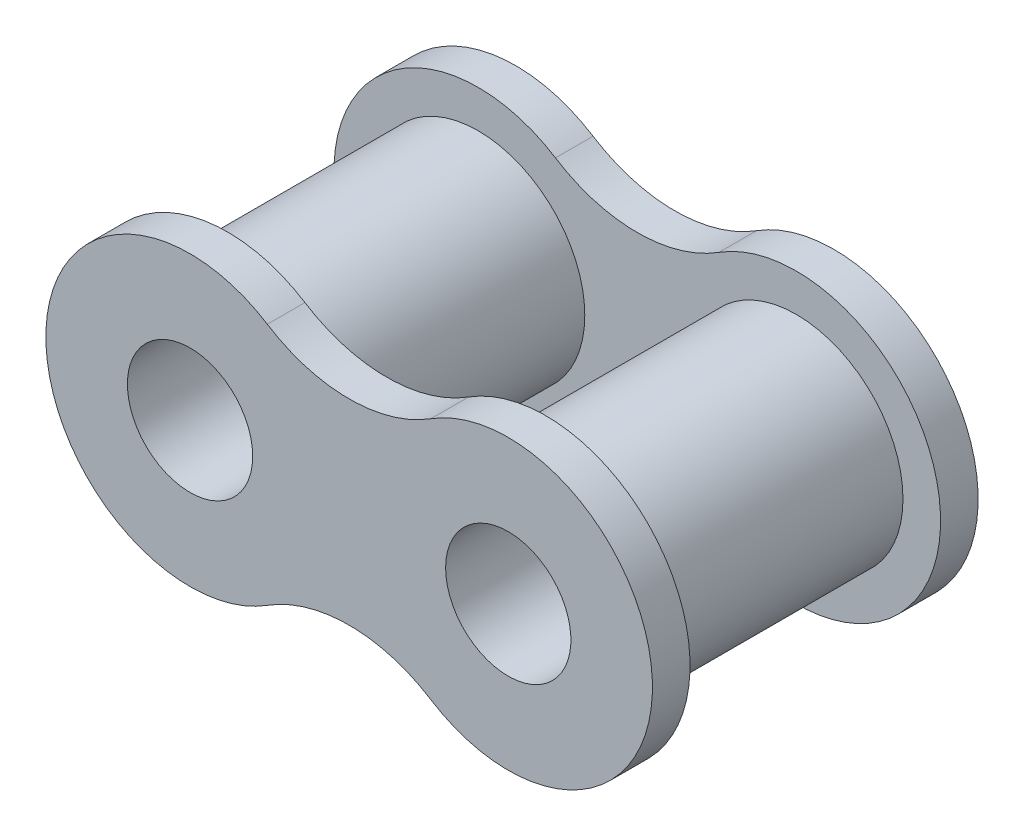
ISO-10303-21;
HEADER;
FILE_DESCRIPTION(('STEP AP214'),'2;1');
FILE_NAME('part.step','',(''),(''),'','','');
FILE_SCHEMA(('AUTOMOTIVE_DESIGN { 1 0 10303 214 1 1 1 1 }'));
ENDSEC;
DATA;
#1=APPLICATION_CONTEXT('core data for automotive mechanical design processes');
#2=APPLICATION_PROTOCOL_DEFINITION('international standard','automotive_design',2000,#1);
#3=PRODUCT_CONTEXT('',#1,'mechanical');
#4=PRODUCT('Part','Part','',(#3));
#5=PRODUCT_RELATED_PRODUCT_CATEGORY('part','',(#4));
#6=PRODUCT_DEFINITION_FORMATION('','',#4);
#7=PRODUCT_DEFINITION_CONTEXT('part definition',#1,'design');
#8=PRODUCT_DEFINITION('design','',#6,#7);
#9=PRODUCT_DEFINITION_SHAPE('','',#8);
#10=(LENGTH_UNIT() NAMED_UNIT(*) SI_UNIT(.MILLI.,.METRE.));
#11=(NAMED_UNIT(*) PLANE_ANGLE_UNIT() SI_UNIT($,.RADIAN.));
#12=(NAMED_UNIT(*) SI_UNIT($,.STERADIAN.) SOLID_ANGLE_UNIT());
#13=UNCERTAINTY_MEASURE_WITH_UNIT(LENGTH_MEASURE(1.E-05),#10,'distance_accuracy_value','');
#14=(GEOMETRIC_REPRESENTATION_CONTEXT(3) GLOBAL_UNCERTAINTY_ASSIGNED_CONTEXT((#13)) GLOBAL_UNIT_ASSIGNED_CONTEXT((#10,
#11,#12)) REPRESENTATION_CONTEXT('',''));
#15=CARTESIAN_POINT('',(0.,0.,0.));
#16=DIRECTION('',(0.,0.,1.));
#17=DIRECTION('',(1.,0.,0.));
#18=AXIS2_PLACEMENT_3D('',#15,#16,#17);
#19=CARTESIAN_POINT('',(3.175,5.,-5.));
#20=DIRECTION('',(0.,0.,1.));
#21=DIRECTION('',(1.,0.,0.));
#22=AXIS2_PLACEMENT_3D('',#19,#20,#21);
#23=PLANE('',#22);
#24=CARTESIAN_POINT('',(0.,10.,-5.));
#25=DIRECTION('',(0.,0.,1.));
#26=DIRECTION('',(1.,0.,0.));
#27=AXIS2_PLACEMENT_3D('',#24,#25,#26);
#28=CIRCLE('',#27,6.09077983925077);
#29=CARTESIAN_POINT('',(-3.26499837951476,4.85827026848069,-5.));
#30=VERTEX_POINT('',#29);
#31=CARTESIAN_POINT('',(3.26499837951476,4.85827026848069,-5.));
#32=VERTEX_POINT('',#31);
#33=EDGE_CURVE('E160',#30,#32,#28,.T.);
#34=ORIENTED_EDGE('',*,*,#33,.F.);
#35=CARTESIAN_POINT('',(-6.35,0.,-5.));
#36=DIRECTION('',(0.,0.,1.));
#37=DIRECTION('',(1.,0.,0.));
#38=AXIS2_PLACEMENT_3D('',#35,#36,#37);
#39=CIRCLE('',#38,5.755);
#40=CARTESIAN_POINT('',(-3.26499837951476,-4.85827026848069,-5.));
#41=VERTEX_POINT('',#40);
#42=EDGE_CURVE('E165',#30,#41,#39,.T.);
#43=ORIENTED_EDGE('',*,*,#42,.T.);
#44=CARTESIAN_POINT('',(0.,-10.,-5.));
#45=DIRECTION('',(0.,0.,-1.));
#46=DIRECTION('',(-1.,0.,0.));
#47=AXIS2_PLACEMENT_3D('',#44,#45,#46);
#48=CIRCLE('',#47,6.09077983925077);
#49=CARTESIAN_POINT('',(3.26499837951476,-4.85827026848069,-5.));
#50=VERTEX_POINT('',#49);
#51=EDGE_CURVE('E176',#41,#50,#48,.T.);
#52=ORIENTED_EDGE('',*,*,#51,.T.);
#53=CARTESIAN_POINT('',(6.35,0.,-5.));
#54=DIRECTION('',(0.,0.,-1.));
#55=DIRECTION('',(-1.,0.,0.));
#56=AXIS2_PLACEMENT_3D('',#53,#54,#55);
#57=CIRCLE('',#56,5.755);
#58=EDGE_CURVE('E173',#32,#50,#57,.T.);
#59=ORIENTED_EDGE('',*,*,#58,.F.);
#60=EDGE_LOOP('',(#34,#43,#52,#59));
#61=FACE_BOUND('',#60,.T.);
#62=CARTESIAN_POINT('',(6.35,0.,-5.));
#63=DIRECTION('',(0.,0.,1.));
#64=DIRECTION('',(1.,0.,0.));
#65=AXIS2_PLACEMENT_3D('',#62,#63,#64);
#66=CIRCLE('',#65,4.255);
#67=CARTESIAN_POINT('',(10.605,0.,-5.));
#68=VERTEX_POINT('',#67);
#69=EDGE_CURVE('E11',#68,#68,#66,.F.);
#70=ORIENTED_EDGE('',*,*,#69,.T.);
#71=EDGE_LOOP('',(#70));
#72=FACE_BOUND('',#71,.T.);
#73=CARTESIAN_POINT('',(-6.35,0.,-5.));
#74=DIRECTION('',(0.,0.,1.));
#75=DIRECTION('',(1.,0.,0.));
#76=AXIS2_PLACEMENT_3D('',#73,#74,#75);
#77=CIRCLE('',#76,4.255);
#78=CARTESIAN_POINT('',(-2.095,0.,-5.));
#79=VERTEX_POINT('',#78);
#80=EDGE_CURVE('E157',#79,#79,#77,.T.);
#81=ORIENTED_EDGE('',*,*,#80,.F.);
#82=EDGE_LOOP('',(#81));
#83=FACE_BOUND('',#82,.T.);
#84=ADVANCED_FACE('F37',(#61,#72,#83),#23,.T.);
#85=CARTESIAN_POINT('',(6.35,0.,5.));
#86=DIRECTION('',(0.,0.,-1.));
#87=DIRECTION('',(-1.,0.,0.));
#88=AXIS2_PLACEMENT_3D('',#85,#86,#87);
#89=CYLINDRICAL_SURFACE('',#88,4.255);
#90=CARTESIAN_POINT('',(6.35,0.,5.));
#91=DIRECTION('',(0.,0.,-1.));
#92=DIRECTION('',(-1.,0.,0.));
#93=AXIS2_PLACEMENT_3D('',#90,#91,#92);
#94=CIRCLE('',#93,4.255);
#95=CARTESIAN_POINT('',(2.095,0.,5.));
#96=VERTEX_POINT('',#95);
#97=EDGE_CURVE('E119',#96,#96,#94,.F.);
#98=ORIENTED_EDGE('',*,*,#97,.F.);
#99=EDGE_LOOP('',(#98));
#100=FACE_BOUND('',#99,.T.);
#101=ORIENTED_EDGE('',*,*,#69,.F.);
#102=EDGE_LOOP('',(#101));
#103=FACE_BOUND('',#102,.T.);
#104=ADVANCED_FACE('F39',(#100,#103),#89,.T.);
#105=CARTESIAN_POINT('',(0.,10.,-6.5));
#106=DIRECTION('',(0.,0.,1.));
#107=DIRECTION('',(1.,0.,0.));
#108=AXIS2_PLACEMENT_3D('',#105,#106,#107);
#109=CYLINDRICAL_SURFACE('',#108,6.09077983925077);
#110=ORIENTED_EDGE('',*,*,#33,.T.);
#111=DIRECTION('',(0.,0.,1.));
#112=VECTOR('',#111,1.);
#113=CARTESIAN_POINT('',(3.26499837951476,4.85827026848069,-6.5));
#114=LINE('',#113,#112);
#115=CARTESIAN_POINT('',(3.26499837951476,4.85827026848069,-6.5));
#116=VERTEX_POINT('',#115);
#117=EDGE_CURVE('E46',#116,#32,#114,.T.);
#118=ORIENTED_EDGE('',*,*,#117,.F.);
#119=CARTESIAN_POINT('',(0.,10.,-6.5));
#120=DIRECTION('',(0.,0.,1.));
#121=DIRECTION('',(1.,0.,0.));
#122=AXIS2_PLACEMENT_3D('',#119,#120,#121);
#123=CIRCLE('',#122,6.09077983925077);
#124=CARTESIAN_POINT('',(-3.26499837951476,4.85827026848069,-6.5));
#125=VERTEX_POINT('',#124);
#126=EDGE_CURVE('E163',#125,#116,#123,.T.);
#127=ORIENTED_EDGE('',*,*,#126,.F.);
#128=DIRECTION('',(0.,0.,1.));
#129=VECTOR('',#128,1.);
#130=CARTESIAN_POINT('',(-3.26499837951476,4.85827026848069,-6.5));
#131=LINE('',#130,#129);
#132=EDGE_CURVE('E54',#125,#30,#131,.T.);
#133=ORIENTED_EDGE('',*,*,#132,.T.);
#134=EDGE_LOOP('',(#110,#118,#127,#133));
#135=FACE_BOUND('',#134,.T.);
#136=ADVANCED_FACE('F186',(#135),#109,.F.);
#137=CARTESIAN_POINT('',(6.35,0.,-6.5));
#138=DIRECTION('',(0.,0.,1.));
#139=DIRECTION('',(1.,0.,0.));
#140=AXIS2_PLACEMENT_3D('',#137,#138,#139);
#141=CYLINDRICAL_SURFACE('',#140,5.755);
#142=ORIENTED_EDGE('',*,*,#58,.T.);
#143=DIRECTION('',(0.,0.,1.));
#144=VECTOR('',#143,1.);
#145=CARTESIAN_POINT('',(3.26499837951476,-4.85827026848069,-6.5));
#146=LINE('',#145,#144);
#147=CARTESIAN_POINT('',(3.26499837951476,-4.85827026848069,-6.5));
#148=VERTEX_POINT('',#147);
#149=EDGE_CURVE('E183',#148,#50,#146,.T.);
#150=ORIENTED_EDGE('',*,*,#149,.F.);
#151=CARTESIAN_POINT('',(6.35,0.,-6.5));
#152=DIRECTION('',(0.,0.,-1.));
#153=DIRECTION('',(-1.,0.,0.));
#154=AXIS2_PLACEMENT_3D('',#151,#152,#153);
#155=CIRCLE('',#154,5.755);
#156=EDGE_CURVE('E81',#116,#148,#155,.T.);
#157=ORIENTED_EDGE('',*,*,#156,.F.);
#158=ORIENTED_EDGE('',*,*,#117,.T.);
#159=EDGE_LOOP('',(#142,#150,#157,#158));
#160=FACE_BOUND('',#159,.T.);
#161=ADVANCED_FACE('F185',(#160),#141,.T.);
#162=CARTESIAN_POINT('',(0.,-10.,-6.5));
#163=DIRECTION('',(0.,0.,1.));
#164=DIRECTION('',(1.,0.,0.));
#165=AXIS2_PLACEMENT_3D('',#162,#163,#164);
#166=CYLINDRICAL_SURFACE('',#165,6.09077983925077);
#167=ORIENTED_EDGE('',*,*,#51,.F.);
#168=DIRECTION('',(0.,0.,1.));
#169=VECTOR('',#168,1.);
#170=CARTESIAN_POINT('',(-3.26499837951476,-4.85827026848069,-6.5));
#171=LINE('',#170,#169);
#172=CARTESIAN_POINT('',(-3.26499837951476,-4.85827026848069,-6.5));
#173=VERTEX_POINT('',#172);
#174=EDGE_CURVE('E69',#173,#41,#171,.T.);
#175=ORIENTED_EDGE('',*,*,#174,.F.);
#176=CARTESIAN_POINT('',(0.,-10.,-6.5));
#177=DIRECTION('',(0.,0.,-1.));
#178=DIRECTION('',(-1.,0.,0.));
#179=AXIS2_PLACEMENT_3D('',#176,#177,#178);
#180=CIRCLE('',#179,6.09077983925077);
#181=EDGE_CURVE('E167',#173,#148,#180,.T.);
#182=ORIENTED_EDGE('',*,*,#181,.T.);
#183=ORIENTED_EDGE('',*,*,#149,.T.);
#184=EDGE_LOOP('',(#167,#175,#182,#183));
#185=FACE_BOUND('',#184,.T.);
#186=ADVANCED_FACE('F192',(#185),#166,.F.);
#187=CARTESIAN_POINT('',(-6.35,0.,-6.5));
#188=DIRECTION('',(0.,0.,1.));
#189=DIRECTION('',(1.,0.,0.));
#190=AXIS2_PLACEMENT_3D('',#187,#188,#189);
#191=CYLINDRICAL_SURFACE('',#190,5.755);
#192=ORIENTED_EDGE('',*,*,#42,.F.);
#193=ORIENTED_EDGE('',*,*,#132,.F.);
#194=CARTESIAN_POINT('',(-6.35,0.,-6.5));
#195=DIRECTION('',(0.,0.,1.));
#196=DIRECTION('',(1.,0.,0.));
#197=AXIS2_PLACEMENT_3D('',#194,#195,#196);
#198=CIRCLE('',#197,5.755);
#199=EDGE_CURVE('E170',#125,#173,#198,.T.);
#200=ORIENTED_EDGE('',*,*,#199,.T.);
#201=ORIENTED_EDGE('',*,*,#174,.T.);
#202=EDGE_LOOP('',(#192,#193,#200,#201));
#203=FACE_BOUND('',#202,.T.);
#204=ADVANCED_FACE('F189',(#203),#191,.T.);
#205=CARTESIAN_POINT('',(3.175,5.,-6.5));
#206=DIRECTION('',(0.,0.,1.));
#207=DIRECTION('',(1.,0.,0.));
#208=AXIS2_PLACEMENT_3D('',#205,#206,#207);
#209=PLANE('',#208);
#210=CARTESIAN_POINT('',(6.35,0.,-6.5));
#211=DIRECTION('',(0.,0.,1.));
#212=DIRECTION('',(-1.,0.,0.));
#213=AXIS2_PLACEMENT_3D('',#210,#211,#212);
#214=CIRCLE('',#213,2.5);
#215=CARTESIAN_POINT('',(3.85,0.,-6.5));
#216=VERTEX_POINT('',#215);
#217=EDGE_CURVE('E244',#216,#216,#214,.T.);
#218=ORIENTED_EDGE('',*,*,#217,.T.);
#219=EDGE_LOOP('',(#218));
#220=FACE_BOUND('',#219,.T.);
#221=CARTESIAN_POINT('',(-6.35,0.,-6.5));
#222=DIRECTION('',(0.,0.,1.));
#223=DIRECTION('',(1.,0.,0.));
#224=AXIS2_PLACEMENT_3D('',#221,#222,#223);
#225=CIRCLE('',#224,2.5);
#226=CARTESIAN_POINT('',(-3.85,0.,-6.5));
#227=VERTEX_POINT('',#226);
#228=EDGE_CURVE('E139',#227,#227,#225,.T.);
#229=ORIENTED_EDGE('',*,*,#228,.T.);
#230=EDGE_LOOP('',(#229));
#231=FACE_BOUND('',#230,.T.);
#232=ORIENTED_EDGE('',*,*,#126,.T.);
#233=ORIENTED_EDGE('',*,*,#156,.T.);
#234=ORIENTED_EDGE('',*,*,#181,.F.);
#235=ORIENTED_EDGE('',*,*,#199,.F.);
#236=EDGE_LOOP('',(#232,#233,#234,#235));
#237=FACE_BOUND('',#236,.T.);
#238=ADVANCED_FACE('F191',(#220,#231,#237),#209,.F.);
#239=CARTESIAN_POINT('',(-6.35,0.,5.));
#240=DIRECTION('',(0.,0.,-1.));
#241=DIRECTION('',(-1.,0.,0.));
#242=AXIS2_PLACEMENT_3D('',#239,#240,#241);
#243=CYLINDRICAL_SURFACE('',#242,4.255);
#244=CARTESIAN_POINT('',(-6.35,0.,5.));
#245=DIRECTION('',(0.,0.,1.));
#246=DIRECTION('',(1.,0.,0.));
#247=AXIS2_PLACEMENT_3D('',#244,#245,#246);
#248=CIRCLE('',#247,4.255);
#249=CARTESIAN_POINT('',(-2.095,0.,5.));
#250=VERTEX_POINT('',#249);
#251=EDGE_CURVE('E156',#250,#250,#248,.T.);
#252=ORIENTED_EDGE('',*,*,#251,.F.);
#253=EDGE_LOOP('',(#252));
#254=FACE_BOUND('',#253,.T.);
#255=ORIENTED_EDGE('',*,*,#80,.T.);
#256=EDGE_LOOP('',(#255));
#257=FACE_BOUND('',#256,.T.);
#258=ADVANCED_FACE('F198',(#254,#257),#243,.T.);
#259=CARTESIAN_POINT('',(3.175,5.,5.));
#260=DIRECTION('',(0.,0.,-1.));
#261=DIRECTION('',(1.,0.,0.));
#262=AXIS2_PLACEMENT_3D('',#259,#260,#261);
#263=PLANE('',#262);
#264=ORIENTED_EDGE('',*,*,#97,.T.);
#265=EDGE_LOOP('',(#264));
#266=FACE_BOUND('',#265,.T.);
#267=CARTESIAN_POINT('',(0.,10.,5.));
#268=DIRECTION('',(0.,0.,1.));
#269=DIRECTION('',(1.,0.,0.));
#270=AXIS2_PLACEMENT_3D('',#267,#268,#269);
#271=CIRCLE('',#270,6.09077983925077);
#272=CARTESIAN_POINT('',(-3.26499837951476,4.85827026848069,5.));
#273=VERTEX_POINT('',#272);
#274=CARTESIAN_POINT('',(3.26499837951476,4.85827026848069,5.));
#275=VERTEX_POINT('',#274);
#276=EDGE_CURVE('E116',#273,#275,#271,.T.);
#277=ORIENTED_EDGE('',*,*,#276,.T.);
#278=CARTESIAN_POINT('',(6.35,0.,5.));
#279=DIRECTION('',(0.,0.,-1.));
#280=DIRECTION('',(-1.,0.,0.));
#281=AXIS2_PLACEMENT_3D('',#278,#279,#280);
#282=CIRCLE('',#281,5.755);
#283=CARTESIAN_POINT('',(3.26499837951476,-4.85827026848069,5.));
#284=VERTEX_POINT('',#283);
#285=EDGE_CURVE('E133',#275,#284,#282,.T.);
#286=ORIENTED_EDGE('',*,*,#285,.T.);
#287=CARTESIAN_POINT('',(0.,-10.,5.));
#288=DIRECTION('',(0.,0.,-1.));
#289=DIRECTION('',(-1.,0.,0.));
#290=AXIS2_PLACEMENT_3D('',#287,#288,#289);
#291=CIRCLE('',#290,6.09077983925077);
#292=CARTESIAN_POINT('',(-3.26499837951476,-4.85827026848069,5.));
#293=VERTEX_POINT('',#292);
#294=EDGE_CURVE('E136',#293,#284,#291,.T.);
#295=ORIENTED_EDGE('',*,*,#294,.F.);
#296=CARTESIAN_POINT('',(-6.35,0.,5.));
#297=DIRECTION('',(0.,0.,1.));
#298=DIRECTION('',(1.,0.,0.));
#299=AXIS2_PLACEMENT_3D('',#296,#297,#298);
#300=CIRCLE('',#299,5.755);
#301=EDGE_CURVE('E146',#273,#293,#300,.T.);
#302=ORIENTED_EDGE('',*,*,#301,.F.);
#303=EDGE_LOOP('',(#277,#286,#295,#302));
#304=FACE_BOUND('',#303,.T.);
#305=ORIENTED_EDGE('',*,*,#251,.T.);
#306=EDGE_LOOP('',(#305));
#307=FACE_BOUND('',#306,.T.);
#308=ADVANCED_FACE('F212',(#266,#304,#307),#263,.T.);
#309=CARTESIAN_POINT('',(0.,10.,6.5));
#310=DIRECTION('',(0.,0.,-1.));
#311=DIRECTION('',(-1.,0.,0.));
#312=AXIS2_PLACEMENT_3D('',#309,#310,#311);
#313=CYLINDRICAL_SURFACE('',#312,6.09077983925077);
#314=ORIENTED_EDGE('',*,*,#276,.F.);
#315=DIRECTION('',(0.,0.,-1.));
#316=VECTOR('',#315,1.);
#317=CARTESIAN_POINT('',(-3.26499837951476,4.85827026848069,6.5));
#318=LINE('',#317,#316);
#319=CARTESIAN_POINT('',(-3.26499837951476,4.85827026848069,6.5));
#320=VERTEX_POINT('',#319);
#321=EDGE_CURVE('E109',#320,#273,#318,.T.);
#322=ORIENTED_EDGE('',*,*,#321,.F.);
#323=CARTESIAN_POINT('',(0.,10.,6.5));
#324=DIRECTION('',(0.,0.,1.));
#325=DIRECTION('',(1.,0.,0.));
#326=AXIS2_PLACEMENT_3D('',#323,#324,#325);
#327=CIRCLE('',#326,6.09077983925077);
#328=CARTESIAN_POINT('',(3.26499837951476,4.85827026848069,6.5));
#329=VERTEX_POINT('',#328);
#330=EDGE_CURVE('E113',#320,#329,#327,.T.);
#331=ORIENTED_EDGE('',*,*,#330,.T.);
#332=DIRECTION('',(0.,0.,-1.));
#333=VECTOR('',#332,1.);
#334=CARTESIAN_POINT('',(3.26499837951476,4.85827026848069,6.5));
#335=LINE('',#334,#333);
#336=EDGE_CURVE('E144',#329,#275,#335,.T.);
#337=ORIENTED_EDGE('',*,*,#336,.T.);
#338=EDGE_LOOP('',(#314,#322,#331,#337));
#339=FACE_BOUND('',#338,.T.);
#340=ADVANCED_FACE('F111',(#339),#313,.F.);
#341=CARTESIAN_POINT('',(-6.35,0.,6.5));
#342=DIRECTION('',(0.,0.,-1.));
#343=DIRECTION('',(-1.,0.,0.));
#344=AXIS2_PLACEMENT_3D('',#341,#342,#343);
#345=CYLINDRICAL_SURFACE('',#344,5.755);
#346=ORIENTED_EDGE('',*,*,#301,.T.);
#347=DIRECTION('',(0.,0.,-1.));
#348=VECTOR('',#347,1.);
#349=CARTESIAN_POINT('',(-3.26499837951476,-4.85827026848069,6.5));
#350=LINE('',#349,#348);
#351=CARTESIAN_POINT('',(-3.26499837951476,-4.85827026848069,6.5));
#352=VERTEX_POINT('',#351);
#353=EDGE_CURVE('E120',#352,#293,#350,.T.);
#354=ORIENTED_EDGE('',*,*,#353,.F.);
#355=CARTESIAN_POINT('',(-6.35,0.,6.5));
#356=DIRECTION('',(0.,0.,1.));
#357=DIRECTION('',(1.,0.,0.));
#358=AXIS2_PLACEMENT_3D('',#355,#356,#357);
#359=CIRCLE('',#358,5.755);
#360=EDGE_CURVE('E123',#320,#352,#359,.T.);
#361=ORIENTED_EDGE('',*,*,#360,.F.);
#362=ORIENTED_EDGE('',*,*,#321,.T.);
#363=EDGE_LOOP('',(#346,#354,#361,#362));
#364=FACE_BOUND('',#363,.T.);
#365=ADVANCED_FACE('F124',(#364),#345,.T.);
#366=CARTESIAN_POINT('',(0.,-10.,6.5));
#367=DIRECTION('',(0.,0.,-1.));
#368=DIRECTION('',(-1.,0.,0.));
#369=AXIS2_PLACEMENT_3D('',#366,#367,#368);
#370=CYLINDRICAL_SURFACE('',#369,6.09077983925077);
#371=ORIENTED_EDGE('',*,*,#294,.T.);
#372=DIRECTION('',(0.,0.,-1.));
#373=VECTOR('',#372,1.);
#374=CARTESIAN_POINT('',(3.26499837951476,-4.85827026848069,6.5));
#375=LINE('',#374,#373);
#376=CARTESIAN_POINT('',(3.26499837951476,-4.85827026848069,6.5));
#377=VERTEX_POINT('',#376);
#378=EDGE_CURVE('E151',#377,#284,#375,.T.);
#379=ORIENTED_EDGE('',*,*,#378,.F.);
#380=CARTESIAN_POINT('',(0.,-10.,6.5));
#381=DIRECTION('',(0.,0.,-1.));
#382=DIRECTION('',(-1.,0.,0.));
#383=AXIS2_PLACEMENT_3D('',#380,#381,#382);
#384=CIRCLE('',#383,6.09077983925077);
#385=EDGE_CURVE('E128',#352,#377,#384,.T.);
#386=ORIENTED_EDGE('',*,*,#385,.F.);
#387=ORIENTED_EDGE('',*,*,#353,.T.);
#388=EDGE_LOOP('',(#371,#379,#386,#387));
#389=FACE_BOUND('',#388,.T.);
#390=ADVANCED_FACE('F218',(#389),#370,.F.);
#391=CARTESIAN_POINT('',(6.35,0.,6.5));
#392=DIRECTION('',(0.,0.,-1.));
#393=DIRECTION('',(-1.,0.,0.));
#394=AXIS2_PLACEMENT_3D('',#391,#392,#393);
#395=CYLINDRICAL_SURFACE('',#394,5.755);
#396=ORIENTED_EDGE('',*,*,#285,.F.);
#397=ORIENTED_EDGE('',*,*,#336,.F.);
#398=CARTESIAN_POINT('',(6.35,0.,6.5));
#399=DIRECTION('',(0.,0.,-1.));
#400=DIRECTION('',(-1.,0.,0.));
#401=AXIS2_PLACEMENT_3D('',#398,#399,#400);
#402=CIRCLE('',#401,5.755);
#403=EDGE_CURVE('E132',#329,#377,#402,.T.);
#404=ORIENTED_EDGE('',*,*,#403,.T.);
#405=ORIENTED_EDGE('',*,*,#378,.T.);
#406=EDGE_LOOP('',(#396,#397,#404,#405));
#407=FACE_BOUND('',#406,.T.);
#408=ADVANCED_FACE('F221',(#407),#395,.T.);
#409=CARTESIAN_POINT('',(3.175,5.,6.5));
#410=DIRECTION('',(0.,0.,-1.));
#411=DIRECTION('',(1.,0.,0.));
#412=AXIS2_PLACEMENT_3D('',#409,#410,#411);
#413=PLANE('',#412);
#414=CARTESIAN_POINT('',(6.35,0.,6.5));
#415=DIRECTION('',(0.,0.,1.));
#416=DIRECTION('',(-1.,0.,0.));
#417=AXIS2_PLACEMENT_3D('',#414,#415,#416);
#418=CIRCLE('',#417,2.5);
#419=CARTESIAN_POINT('',(3.85,0.,6.5));
#420=VERTEX_POINT('',#419);
#421=EDGE_CURVE('E247',#420,#420,#418,.T.);
#422=ORIENTED_EDGE('',*,*,#421,.F.);
#423=EDGE_LOOP('',(#422));
#424=FACE_BOUND('',#423,.T.);
#425=CARTESIAN_POINT('',(-6.35,0.,6.5));
#426=DIRECTION('',(0.,0.,1.));
#427=DIRECTION('',(1.,0.,0.));
#428=AXIS2_PLACEMENT_3D('',#425,#426,#427);
#429=CIRCLE('',#428,2.5);
#430=CARTESIAN_POINT('',(-3.85,0.,6.5));
#431=VERTEX_POINT('',#430);
#432=EDGE_CURVE('E249',#431,#431,#429,.T.);
#433=ORIENTED_EDGE('',*,*,#432,.F.);
#434=EDGE_LOOP('',(#433));
#435=FACE_BOUND('',#434,.T.);
#436=ORIENTED_EDGE('',*,*,#330,.F.);
#437=ORIENTED_EDGE('',*,*,#360,.T.);
#438=ORIENTED_EDGE('',*,*,#385,.T.);
#439=ORIENTED_EDGE('',*,*,#403,.F.);
#440=EDGE_LOOP('',(#436,#437,#438,#439));
#441=FACE_BOUND('',#440,.T.);
#442=ADVANCED_FACE('F130',(#424,#435,#441),#413,.F.);
#443=CARTESIAN_POINT('',(-6.35,0.,-6.5));
#444=DIRECTION('',(0.,0.,1.));
#445=DIRECTION('',(1.,0.,0.));
#446=AXIS2_PLACEMENT_3D('',#443,#444,#445);
#447=CYLINDRICAL_SURFACE('',#446,2.5);
#448=ORIENTED_EDGE('',*,*,#228,.F.);
#449=EDGE_LOOP('',(#448));
#450=FACE_BOUND('',#449,.T.);
#451=ORIENTED_EDGE('',*,*,#432,.T.);
#452=EDGE_LOOP('',(#451));
#453=FACE_BOUND('',#452,.T.);
#454=ADVANCED_FACE('F231',(#450,#453),#447,.F.);
#455=CARTESIAN_POINT('',(6.35,0.,-6.5));
#456=DIRECTION('',(0.,0.,1.));
#457=DIRECTION('',(1.,0.,0.));
#458=AXIS2_PLACEMENT_3D('',#455,#456,#457);
#459=CYLINDRICAL_SURFACE('',#458,2.5);
#460=ORIENTED_EDGE('',*,*,#217,.F.);
#461=EDGE_LOOP('',(#460));
#462=FACE_BOUND('',#461,.T.);
#463=ORIENTED_EDGE('',*,*,#421,.T.);
#464=EDGE_LOOP('',(#463));
#465=FACE_BOUND('',#464,.T.);
#466=ADVANCED_FACE('F235',(#462,#465),#459,.F.);
#467=CLOSED_SHELL('',(#84,#104,#136,#161,#186,#204,#238,#258,#308,#340,#365,#390,#408,#442,#454,#466));
#468=MANIFOLD_SOLID_BREP('B2',#467);
#469=ADVANCED_BREP_SHAPE_REPRESENTATION('',(#18,#468),#14);
#470=SHAPE_DEFINITION_REPRESENTATION(#9,#469);
ENDSEC;
END-ISO-10303-21;
